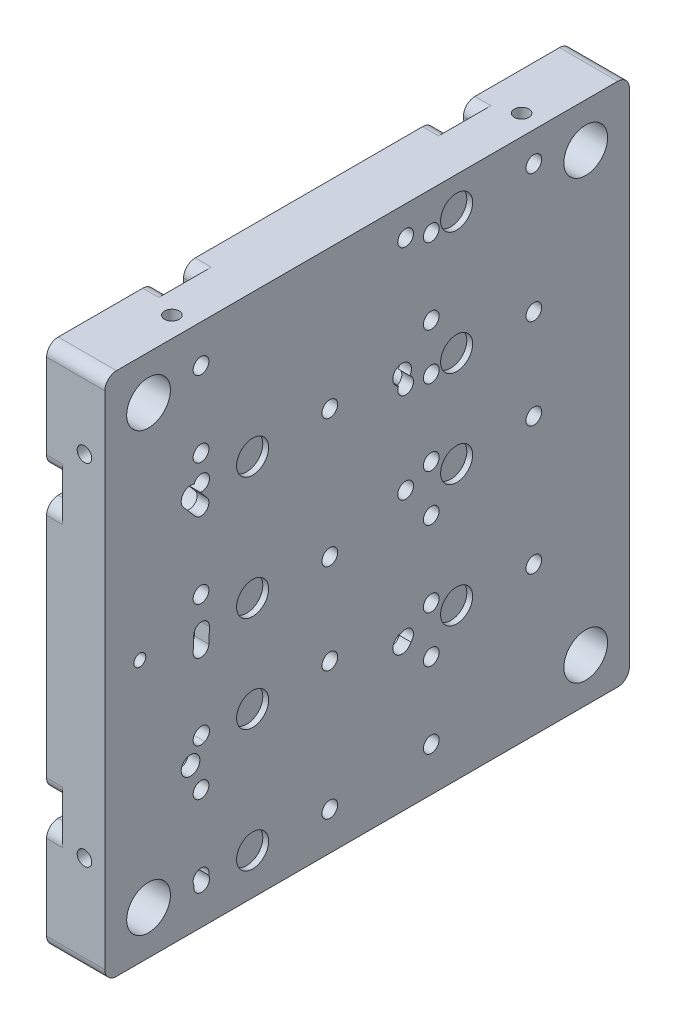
from build123d import *

# Parameters (mm, degrees)
SKETCH_1_W                  = 90
SKETCH_1_H                  = 90
EXTRUDE_1_DEPTH             = 10
CUT_EXTRUDE_1_DEPTH         = 2.75
HOLE_WIZARD_1_D             = 3.3
HOLE_WIZARD_1_DEPTH         = 10.1
HOLE_WIZARD_1_CBORE_D       = 7.5
HOLE_WIZARD_1_CBORE_DEPTH   = 6
HOLE_WIZARD_1_TIP           = 0.991420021
SKETCH_16_R                 = 2.5
CUT_EXTRUDE_3_DEPTH         = 2.75
FILLET_2_R                  = 2
FILLET_1_R                  = 2
HOLE_WIZARD_M3_3_D          = 2.5
HOLE_WIZARD_M3_3_DEPTH      = 5
HOLE_WIZARD_M3_3_TIP        = 0.751075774
HOLE_WIZARD_M3_4_D          = 2.5
HOLE_WIZARD_M3_4_DEPTH      = 6
HOLE_WIZARD_M3_4_TIP        = 0.751075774
HOLE_WIZARD_0_D             = 3.2
HOLE_WIZARD_0_CBORE_D       = 7.5
HOLE_WIZARD_0_CBORE_DEPTH   = 8
HOLE_WIZARD_0_2_D           = 2.7
HOLE_WIZARD_0_2_CBORE_D     = 6.5
HOLE_WIZARD_0_2_CBORE_DEPTH = 7.5
SKETCH_33_R                 = 2.75
CUT_EXTRUDE_7_DEPTH         = 1
HOLE_WIZARD_M3_5_D          = 2.5
HOLE_WIZARD_M3_5_DEPTH      = 7.5
HOLE_WIZARD_M3_5_TIP        = 0.751075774
HOLE_WIZARD_M3_6_D          = 2.5
HOLE_WIZARD_M3_6_DEPTH      = 7.5
HOLE_WIZARD_M3_6_TIP        = 0.751075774
CUT_EXTRUDE_8_DEPTH         = 2.75
CUT_EXTRUDE_10_DEPTH        = 0.5
HOLE_WIZARD_0_3_D           = 2.7
HOLE_WIZARD_0_3_CBORE_D     = 6.5
HOLE_WIZARD_0_3_CBORE_DEPTH = 7.5
PATTERN_LINEAR_1_COUNT      = 4
PATTERN_LINEAR_1_PITCH      = 21
CUT_EXTRUDE_11_DEPTH        = 0.5
CUT_EXTRUDE_12_DEPTH        = 0.5
HOLE_WIZARD_M2_5_1_D        = 2.05
HOLE_WIZARD_M2_5_1_DEPTH    = 6
HOLE_WIZARD_M2_5_1_TIP      = 0.615882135
CUT_EXTRUDE_13_DEPTH        = 2.75
CUT_EXTRUDE_START           = -0.5
CUT_EXTRUDE_14_DEPTH        = 0.5
CUT_EXTRUDE_16_DEPTH        = 10
CUT_EXTRUDE_17_DEPTH        = 10


with BuildPart() as part:
    # Sketch 1 → Extrude 1 (new body)
    with BuildSketch(Plane(origin=(0, 0, 0), x_dir=(0, 0, -1), z_dir=(1, 0, 0))):
        Rectangle(SKETCH_1_W, SKETCH_1_H)
    extrude(amount=EXTRUDE_1_DEPTH)

    # Sketch 2 → Cut-Extrude 1 (cut)
    with BuildSketch(Plane.ZY):
        Polygon((-26.5, -26.5), (26.5, -26.5), (45, -26.5), (45, -21.5), (26.5, -21.5), (26.5, 21.5), (45, 21.5), (45, 26.5), (26.5, 26.5), (26.5, 45), (21.5, 45), (21.5, 26.5), (-21.5, 26.5), (-21.5, 45), (-26.5, 45), (-26.5, 26.5), align=None)
    extrude(amount=-CUT_EXTRUDE_1_DEPTH, mode=Mode.SUBTRACT)

    # Hole Wizard 1
    with Locations(Plane(origin=(10, 0, 0), x_dir=(0, 0, -1), z_dir=(1, 0, 0))):
        with Locations((-37.5, 37.5), (37.5, 37.5), (-37.5, -37.5), (37.5, -37.5)):
            CounterBoreHole(HOLE_WIZARD_1_D / 2, HOLE_WIZARD_1_CBORE_D / 2, HOLE_WIZARD_1_CBORE_DEPTH, depth=HOLE_WIZARD_1_DEPTH)
            with Locations((0, 0, -(HOLE_WIZARD_1_DEPTH + HOLE_WIZARD_1_TIP / 2))):  # 118° drill point
                Cone(0, HOLE_WIZARD_1_D / 2, HOLE_WIZARD_1_TIP, mode=Mode.SUBTRACT)

    # Sketch 16 → Cut-Extrude 3 (cut)
    with BuildSketch(Plane.ZY):
        with Locations((-26.5, 24)):
            Circle(SKETCH_16_R)
        with Locations((-26.5, -24)):
            Circle(SKETCH_16_R)
    extrude(amount=-CUT_EXTRUDE_3_DEPTH, mode=Mode.SUBTRACT)

    # Fillet 2
    fillet_2_edges = [part.edges().sort_by_distance(p)[0] for p in [
        (1.375, 45, -26.5),
        (1.375, 45, -21.5),
        (1.375, 26.5, -21.5),
        (1.375, 26.5, 21.5),
        (1.375, 45, 21.5),
        (1.375, 45, 26.5),
        (1.375, 26.5, 26.5),
        (1.375, 26.5, 45),
        (1.375, 21.5, 45),
        (1.375, 21.5, 26.5),
        (1.375, -21.5, 26.5),
        (1.375, -21.5, 45),
        (1.375, -26.5, 45),
    ]]
    fillet(fillet_2_edges, radius=FILLET_2_R)

    # Fillet 1
    fillet_1_edges = [part.edges().sort_by_distance(p)[0] for p in [
        (5, -45, -45),
        (5, -45, 45),
        (5, 45, 45),
        (5, 45, -45),
    ]]
    fillet(fillet_1_edges, radius=FILLET_1_R)

    # Hole Wizard M3 _3
    with Locations(Plane(origin=(0, -45, 0), x_dir=(-1, 0, 0), z_dir=(0, -1, 0))):
        with Locations((-6.5, -30), (-6.5, 30)):
            Hole(HOLE_WIZARD_M3_3_D / 2, depth=HOLE_WIZARD_M3_3_DEPTH)
            with Locations((0, 0, -(HOLE_WIZARD_M3_3_DEPTH + HOLE_WIZARD_M3_3_TIP / 2))):  # 118° drill point
                Cone(0, HOLE_WIZARD_M3_3_D / 2, HOLE_WIZARD_M3_3_TIP, mode=Mode.SUBTRACT)

    # Hole Wizard M3 _4
    with Locations(Plane(origin=(0, 45, 0), x_dir=(1, 0, 0), z_dir=(0, 1, 0))):
        with Locations((6.5, -30), (6.5, 30)):
            Hole(HOLE_WIZARD_M3_4_D / 2, depth=HOLE_WIZARD_M3_4_DEPTH)
            with Locations((0, 0, -(HOLE_WIZARD_M3_4_DEPTH + HOLE_WIZARD_M3_4_TIP / 2))):  # 118° drill point
                Cone(0, HOLE_WIZARD_M3_4_D / 2, HOLE_WIZARD_M3_4_TIP, mode=Mode.SUBTRACT)

    # Hole Wizard 0 (through all)
    with Locations(Plane.ZY):
        with Locations((30.3, -20), (30.3, 20), (-6, 20), (-6, -20)):
            CounterBoreHole(HOLE_WIZARD_0_D / 2, HOLE_WIZARD_0_CBORE_D / 2, HOLE_WIZARD_0_CBORE_DEPTH)

    # Hole Wizard 0 2 (through all)
    with Locations(Plane.ZY):
        with Locations((-28.6, 39.95), (-6.6, 39.95), (-6.6, 17.95), (-28.6, 17.95), (-28.6, 2.45), (-6.6, 2.45), (-28.6, -19.55), (-6.6, -19.55), (6.4, 21.05), (6.4, -0.95), (6.4, -16.45), (6.4, -38.45), (28.4, -38.45), (28.4, -16.45), (28.4, -0.95), (28.4, 21.05)):
            CounterBoreHole(HOLE_WIZARD_0_2_D / 2, HOLE_WIZARD_0_2_CBORE_D / 2, HOLE_WIZARD_0_2_CBORE_DEPTH)

    # Sketch 33 → Cut-Extrude 7 (cut)
    with BuildSketch(Plane(origin=(10, 0, 0), x_dir=(0, 0, -1), z_dir=(1, 0, 0))):
        with Locations((15.35, 39.45)):
            Circle(SKETCH_33_R)
        with Locations((15.35, 18.45)):
            Circle(SKETCH_33_R)
        with Locations((15.35, 1.95)):
            Circle(SKETCH_33_R)
        with Locations((15.35, -19.05)):
            Circle(SKETCH_33_R)
        with Locations((-19.65, 20.55)):
            Circle(SKETCH_33_R)
        with Locations((-19.65, -0.45)):
            Circle(SKETCH_33_R)
        with Locations((-19.65, -16.95)):
            Circle(SKETCH_33_R)
        with Locations((-19.65, -37.950284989)):
            Circle(SKETCH_33_R)
    extrude(amount=-CUT_EXTRUDE_7_DEPTH, mode=Mode.SUBTRACT)

    # Hole Wizard M3 _5
    with Locations(Plane(origin=(0, 0, -45), x_dir=(-1, 0, 0), z_dir=(0, 0, -1))):
        with Locations((-6.5, -28.146446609), (-6.5, 31.853553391)):
            Hole(HOLE_WIZARD_M3_5_D / 2, depth=HOLE_WIZARD_M3_5_DEPTH)
            with Locations((0, 0, -(HOLE_WIZARD_M3_5_DEPTH + HOLE_WIZARD_M3_5_TIP / 2))):  # 118° drill point
                Cone(0, HOLE_WIZARD_M3_5_D / 2, HOLE_WIZARD_M3_5_TIP, mode=Mode.SUBTRACT)

    # Hole Wizard M3 _6
    with Locations(Plane.XY.offset(45)):
        with Locations((6.5, 31.853553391), (6.5, -28.146446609)):
            Hole(HOLE_WIZARD_M3_6_D / 2, depth=HOLE_WIZARD_M3_6_DEPTH)
            with Locations((0, 0, -(HOLE_WIZARD_M3_6_DEPTH + HOLE_WIZARD_M3_6_TIP / 2))):  # 118° drill point
                Cone(0, HOLE_WIZARD_M3_6_D / 2, HOLE_WIZARD_M3_6_TIP, mode=Mode.SUBTRACT)

    # Sketch 38 → Cut-Extrude 8 (cut)
    with BuildSketch(Plane.ZY):
        with BuildLine():
            Line((26.5, -19.086759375), (26.5, -19.5))
            ThreePointArc((26.5, -19.5), (26.512636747, -19.724471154), (26.550387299, -19.946105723))
            ThreePointArc((26.550387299, -19.946105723), (26.575676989, -19.561915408), (26.640227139, -19.182343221))
            ThreePointArc((26.640227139, -19.182343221), (26.569489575, -19.135466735), (26.5, -19.086759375))
        make_face()
    extrude(amount=-CUT_EXTRUDE_8_DEPTH, mode=Mode.SUBTRACT)

    # Sketch 39 → Cut-Extrude 10 (cut)
    with BuildSketch(Plane.ZY.offset(-7.5)):
        with BuildLine():
            ThreePointArc((-9.640136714, 19.098942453), (-7.512920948, 14.830853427), (-3.420137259, 17.278454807))
            ThreePointArc((-3.420137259, 17.278454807), (-7.053370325, 16.400984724), (-9.640136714, 19.098942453))
        make_face()
        with BuildLine():
            ThreePointArc((31.649595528, -16.501272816), (26.866400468, -13.584590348), (26.640227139, -19.182343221))
            ThreePointArc((26.640227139, -19.182343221), (26.971579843, -18.27253965), (27.524836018, -17.477904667))
            ThreePointArc((27.524836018, -17.477904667), (27.762966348, -15.259752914), (29.740715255, -16.291941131))
            ThreePointArc((29.740715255, -16.291941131), (30.708781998, -16.272346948), (31.649595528, -16.501272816))
        make_face()
        with BuildLine():
            ThreePointArc((30.210595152, 23.748934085), (25.55546501, 22.621979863), (27.078264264, 18.080906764))
            ThreePointArc((27.078264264, 18.080906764), (27.017844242, 21.813822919), (30.210595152, 23.748934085))
        make_face()
    extrude(amount=-CUT_EXTRUDE_10_DEPTH, mode=Mode.SUBTRACT)

    # Hole Wizard 0 3 (through all)
    with Locations(Plane.ZY):
        with Locations((-11, -37.5), (-11, -24.5), (28.5, -37.5), (28.5, -24.5)):
            hole_wizard_0_3 = CounterBoreHole(HOLE_WIZARD_0_3_D / 2, HOLE_WIZARD_0_3_CBORE_D / 2, HOLE_WIZARD_0_3_CBORE_DEPTH)

    # Pattern Linear 1: Hole Wizard 0 3 ×4
    with Locations(*[(0, i * PATTERN_LINEAR_1_PITCH, 0) for i in range(1, PATTERN_LINEAR_1_COUNT)]):
        add(hole_wizard_0_3, mode=Mode.SUBTRACT)

    # Sketch 43 → Cut-Extrude 11 (cut)
    with BuildSketch(Plane.ZY.offset(-7.5)):
        with BuildLine():
            ThreePointArc((-6.610429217, -16.300016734), (-7.18966935, -16.353941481), (-7.750016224, -16.510269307))
            ThreePointArc((-7.750016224, -16.510269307), (-13.671031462, -14.648489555), (-9.849983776, -19.539730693))
            ThreePointArc((-9.849983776, -19.539730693), (-9.818783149, -19.999371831), (-9.722904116, -20.449983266))
            ThreePointArc((-9.722904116, -20.449983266), (-9, -17.75), (-6.610429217, -16.300016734))
        make_face()
    extrude(amount=-CUT_EXTRUDE_11_DEPTH, mode=Mode.SUBTRACT)

    # Sketch 44 → Cut-Extrude 12 (cut)
    with BuildSketch(Plane.ZY.offset(-7.5)):
        with BuildLine():
            ThreePointArc((31.17040586, 23.647587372), (28.296404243, 28.743616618), (26.082185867, 23.328209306))
            ThreePointArc((26.082185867, 23.328209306), (26.937171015, 23.952177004), (27.947314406, 24.268318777))
            ThreePointArc((27.947314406, 24.268318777), (28.530329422, 26.849659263), (28.996799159, 24.24473485))
            ThreePointArc((28.996799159, 24.24473485), (29.628959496, 24.058680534), (30.210595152, 23.748934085))
            ThreePointArc((30.210595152, 23.748934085), (30.693774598, 23.729268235), (31.17040586, 23.647587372))
        make_face()
        with BuildLine():
            ThreePointArc((26.933662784, -21.652354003), (27.292980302, -27.517549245), (31.598137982, -23.518144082))
            ThreePointArc((31.598137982, -23.518144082), (30.595790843, -23.738316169), (29.571291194, -23.678516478))
            ThreePointArc((29.571291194, -23.678516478), (27.998622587, -25.753443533), (28.290777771, -23.166311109))
            ThreePointArc((28.290777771, -23.166311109), (27.507657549, -22.503062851), (26.933662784, -21.652354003))
        make_face()
        with BuildLine():
            ThreePointArc((31.749734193, -16.541565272), (31.260839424, -14.78527971), (29.903229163, -13.568541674))
            ThreePointArc((29.903229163, -13.568541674), (31.192411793, -14.787190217), (31.649595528, -16.501272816))
            ThreePointArc((31.649595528, -16.501272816), (31.699809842, -16.521058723), (31.749734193, -16.541565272))
        make_face()
        with BuildLine():
            ThreePointArc((-9.339300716, -21.706332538), (-13.415705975, -26.674135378), (-8.047439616, -23.14173376))
            ThreePointArc((-8.047439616, -23.14173376), (-8.787353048, -22.508617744), (-9.339300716, -21.706332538))
        make_face()
        with BuildLine():
            ThreePointArc((-9.84096309, 18.192194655), (-12.342994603, 17.362648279), (-9.724838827, 17.056757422))
            ThreePointArc((-9.724838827, 17.056757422), (-9.279805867, 16.111212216), (-8.557694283, 15.355788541))
            ThreePointArc((-8.557694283, 15.355788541), (-14.169913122, 16.782956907), (-9.718296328, 20.486592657))
            ThreePointArc((-9.718296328, 20.486592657), (-9.744065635, 19.789114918), (-9.640136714, 19.098942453))
            ThreePointArc((-9.640136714, 19.098942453), (-9.773105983, 18.65277907), (-9.84096309, 18.192194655))
        make_face()
    extrude(amount=-CUT_EXTRUDE_12_DEPTH, mode=Mode.SUBTRACT)

    # Hole Wizard M2.5 _1
    with Locations(Plane(origin=(10, 0, 0), x_dir=(0, 0, -1), z_dir=(1, 0, 0))):
        with Locations((-39, 0)):
            Hole(HOLE_WIZARD_M2_5_1_D / 2, depth=HOLE_WIZARD_M2_5_1_DEPTH)
            with Locations((0, 0, -(HOLE_WIZARD_M2_5_1_DEPTH + HOLE_WIZARD_M2_5_1_TIP / 2))):  # 118° drill point
                Cone(0, HOLE_WIZARD_M2_5_1_D / 2, HOLE_WIZARD_M2_5_1_TIP, mode=Mode.SUBTRACT)

    # Sketch 47 → Cut-Extrude 13 (cut)
    with BuildSketch(Plane.ZY):
        with BuildLine():
            Line((26.5, 1.938262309), (26.5, 1.686759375))
            ThreePointArc((26.5, 1.686759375), (26.588934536, 1.748618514), (26.679881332, 1.807479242))
            ThreePointArc((26.679881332, 1.807479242), (26.588821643, 1.871331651), (26.5, 1.938262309))
        make_face()
    extrude(amount=-CUT_EXTRUDE_13_DEPTH, mode=Mode.SUBTRACT)

    # Sketch 48 → Cut-Extrude 14 (cut)
    with BuildSketch(Plane.ZY.offset(-7.5).offset(CUT_EXTRUDE_START)):
        with BuildLine():
            ThreePointArc((27.205240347, 17.88222695), (27.71118862, 16.404428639), (29.273157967, 16.393326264))
            ThreePointArc((29.273157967, 16.393326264), (30.435579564, 16.252451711), (31.584782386, 16.476956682))
            ThreePointArc((31.584782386, 16.476956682), (27.130282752, 14.552734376), (25.729062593, 19.198353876))
            ThreePointArc((25.729062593, 19.198353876), (26.326951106, 18.547008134), (27.078264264, 18.080906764))
            ThreePointArc((27.078264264, 18.080906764), (27.140190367, 17.980568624), (27.205240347, 17.88222695))
        make_face()
    extrude(amount=CUT_EXTRUDE_14_DEPTH, mode=Mode.SUBTRACT)

    # Sketch 49 → Cut-Extrude 16 (cut)
    with BuildSketch(Plane.ZY.offset(-8)):
        Polygon((27.472057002, 18.375118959), (29.524028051, 20.785430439), (31.61846608, 19.080476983), (29.527942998, 16.624881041), align=None)
    extrude(amount=-CUT_EXTRUDE_16_DEPTH, mode=Mode.SUBTRACT)

    # Sketch 50 → Cut-Extrude 17 (cut)
    with BuildSketch(Plane.ZY.offset(-7.5)):
        Polygon((29.848963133, -3.447099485), (29.748963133, -0.897099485), (27.051036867, -1.002900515), (27.151036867, -3.552900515), align=None)
    extrude(amount=-CUT_EXTRUDE_17_DEPTH, mode=Mode.SUBTRACT)


solid = part.part
